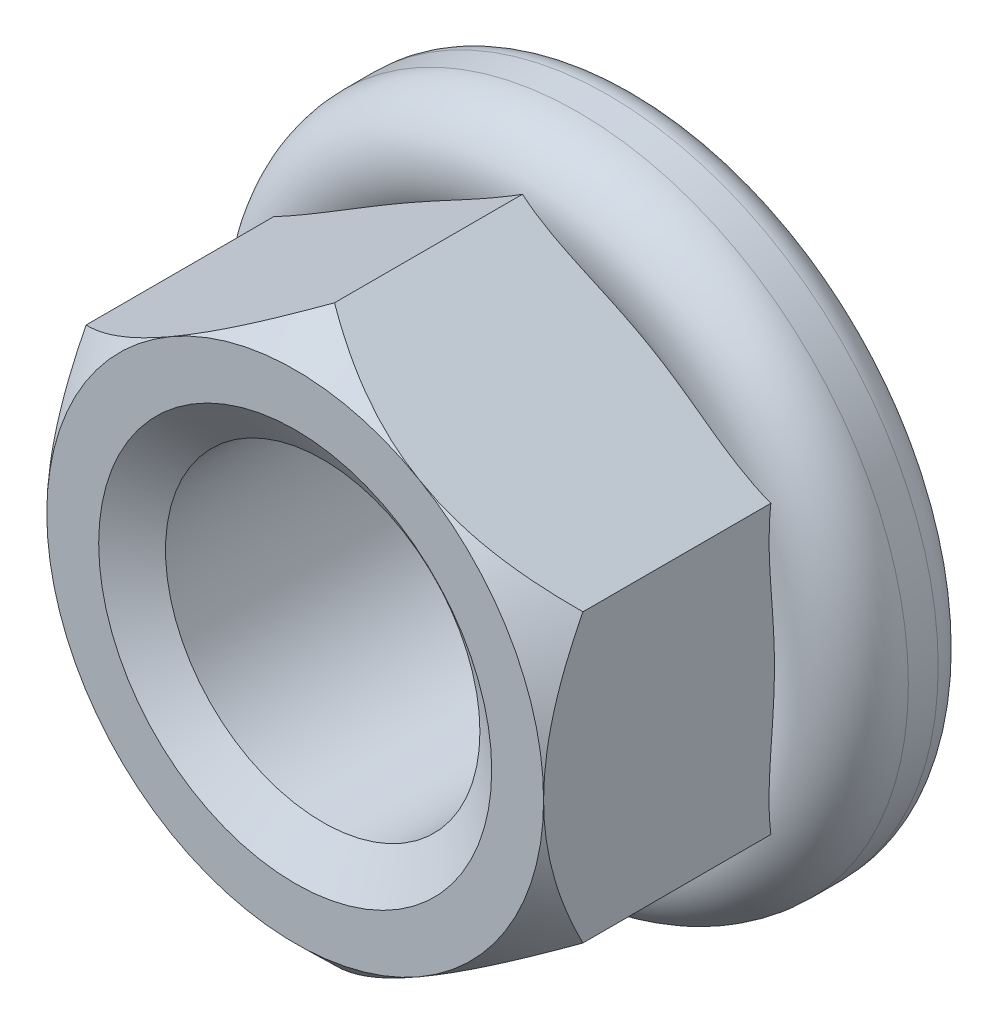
from build123d import *

# Parameters (mm, degrees)
BASENUTSKE_R  = 2.54
BASENUT_DEPTH = 5.5626


with BuildPart() as part:
    # BaseNutSke → BaseNut (new body)
    with BuildSketch(Plane.XY):
        Polygon((4.0132, 2.3170221), (4.0132, -2.3170221), (0, -4.634044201), (-4.0132, -2.3170221), (-4.0132, 2.3170221), (0, 4.634044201), align=None)
        Circle(BASENUTSKE_R, mode=Mode.SUBTRACT)
    extrude(amount=-BASENUT_DEPTH)

    # Sketch3 → Double-Chamfer (revolve, cut)
    with BuildSketch(Plane(origin=(0, 0, 0), x_dir=(0, 0, -1), z_dir=(1, 0, 0))):
        Polygon((0.635, 17.334044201), (-12.7, 17.334044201), (-12.7, 4.0132), (0, 4.0132), (0.635, 4.634044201), align=None)
    revolve(axis=Axis((0, 0, 0), (0, 0, -1)), mode=Mode.SUBTRACT)

    # EndChamferSke → EndChamfer (revolve, cut)
    with BuildSketch(Plane(origin=(0, 0, 0), x_dir=(0, 0, -1), z_dir=(1, 0, 0)), mode=Mode.PRIVATE) as endchamfer_sk:
        Polygon((5.5372, 3.175), (5.048105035, 2.4765), (5.588, 2.4765), (5.588, 3.175), align=None)
        Polygon((-0.0508, 3.175), (0, 3.175), (0.489094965, 2.4765), (-0.0508, 2.4765), align=None)
    revolve(endchamfer_sk.sketch.rotate(Axis((0, 0, -25.037505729), (0, 0, -1)), 90), axis=Axis((0, 0, -25.037505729), (0, 0, -1)), mode=Mode.SUBTRACT)

    # Sketch5 → Revolve1 (revolve)
    with BuildSketch(Plane(origin=(0, 0, 0), x_dir=(0, 0, -1), z_dir=(1, 0, 0)), mode=Mode.PRIVATE) as revolve1_sk:
        with BuildLine():
            Line((5.5626, 3.47553315), (5.5626, 4.826))
            ThreePointArc((5.5626, 4.826), (5.413810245, 5.185210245), (5.0546, 5.334))
            Line((5.0546, 5.334), (4.572, 5.334))
            ThreePointArc((4.572, 5.334), (3.642766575, 4.404766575), (4.572, 3.47553315))
            Line((4.572, 3.47553315), (5.5626, 3.47553315))
        make_face()
    revolve(revolve1_sk.sketch.rotate(Axis((0, 0, 4.49979694), (0, 0, -1)), 90), axis=Axis((0, 0, 4.49979694), (0, 0, -1)))


solid = part.part
